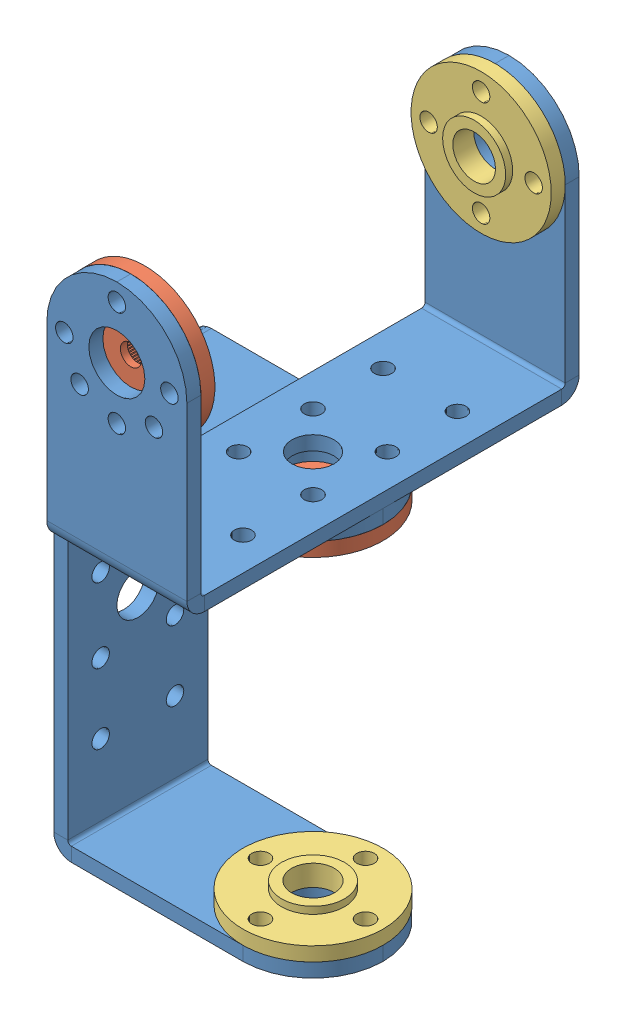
SolidWorks assembly Poignet.SLDASM, configuration Défaut (file format 11000). Lengths in mm.
Overall size (41.14 93 56).
6 component instances, 3 part files, 15 mates.
Components (placement in the parent):
- Chape-1: Chape.SLDPRT [Défaut] at origin size (20 37 56)
- PalierMotreur^AssemblageAccessoiresServo-1: PalierMotreur^AssemblageAccessoiresServo.sldprt [Défaut] at (10 25 25) size (20 20 4.8)
- PalierLibre-1: PalierLibre.SLDPRT [Défaut] at (0 25 -24) x (-1 0 0) z (0 0 -1) size (20 20 3)
- Chape-2: Chape.SLDPRT [Défaut] at (-25 -30 0) x (0 0 -1) z (0 -1 0) size (20 37 56)
- PalierMotreur^AssemblageAccessoiresServo-2: PalierMotreur^AssemblageAccessoiresServo.sldprt [Défaut] at (-7.0711 -5 7.0711) x (-0.707107 0 0.707107) z (0 1 0) size (20 20 4.8)
- PalierLibre-2: PalierLibre.SLDPRT [Défaut] at (0 -54 0) x (-1 0 0) z (0 -1 0) size (20 20 3)
Mates (geometry in assembly coordinates):
- Coïncidente1: coincident: plane of assembly; plane of assembly; plane of Chape-1 through (10 0 26) normal (0 0 -1); plane of PalierMotreur^AssemblageAccessoiresServo-1 through (0 25 26) normal (0 0 1)
- Coaxiale1: concentric: cylinder of assembly; cylinder of assembly; cylinder of Chape-1 through (0 25 -28) axis (0 0 1) radius 4; cylinder of PalierMotreur^AssemblageAccessoiresServo-1 through (0 25 21.2) axis (0 0 1) radius 4.5
- Coaxiale2: concentric: cylinder of assembly; cylinder of assembly; cylinder of Chape-1 through (7.5 25 -28) axis (0 0 1) radius 1.25; cylinder of PalierMotreur^AssemblageAccessoiresServo-1 through (7.5 25 19.7574) axis (0 0 1) radius 1.25
- Coïncidente2: coincident: plane of assembly; plane of assembly; plane of Chape-1 through (10 0 -26) normal (0 0 1); plane of PalierLibre-1 through (0 25 -26) normal (0 0 -1)
- Coaxiale3: concentric: cylinder of assembly; cylinder of assembly; cylinder of Chape-1 through (0 25 -28) axis (0 0 1) radius 4; cylinder of PalierLibre-1 through (0 25 -23) axis (0 0 -1) radius 3.05
- Coaxiale4: concentric: cylinder of assembly; cylinder of assembly; cylinder of Chape-1 through (0 17.5 -28) axis (0 0 1) radius 1.25; cylinder of PalierLibre-1 through (0 17.5 -26) axis (0 0 1) radius 1.25
- Coïncidente3: coincident: plane of assembly; plane of assembly; plane of Chape-1 through (10 -2 -26) normal (0 -1 0); plane of Chape-2 through (-25 -2 -10) normal (0 1 0)
- Coaxiale5: concentric: cylinder of assembly; cylinder of assembly; cylinder of Chape-1 through (0 -2 0) axis (0 1 0) radius 3; cylinder of Chape-2 through (0 -2 0) axis (0 -1 0) radius 4
- Perpendiculaire1: perpendicular: plane of assembly; plane of assembly; plane of Chape-1 through (-10 0.5 -28) normal (-1 0 0); plane of Chape-2 through (-24.5 -4.5 10) normal (0 0 1)
- Coaxiale6: concentric: cylinder of assembly; cylinder of assembly; cylinder of Chape-2 through (0 -2 0) axis (0 -1 0) radius 4; cylinder of PalierMotreur^AssemblageAccessoiresServo-2 through (0 -10.2426 0) axis (0 1 0) radius 1.5
- Coïncidente5: coincident: plane of assembly; plane of assembly; plane of Chape-2 through (-25 -4 -10) normal (0 -1 0); plane of PalierMotreur^AssemblageAccessoiresServo-2 through (0 -4 0) normal (0 1 0)
- Coaxiale7: concentric: cylinder of assembly; cylinder of assembly; cylinder of Chape-2 through (-5.3033 -2 -5.3033) axis (0 -1 0) radius 1.25; cylinder of PalierMotreur^AssemblageAccessoiresServo-2 through (-5.3033 -10.2426 -5.3033) axis (0 1 0) radius 1.25
- Coïncidente6: coincident: plane of assembly; plane of assembly; plane of Chape-2 through (-25 -56 -10) normal (0 1 0); plane of PalierLibre-2 through (0 -56 0) normal (0 -1 0)
- Coaxiale8: concentric: cylinder of assembly; cylinder of assembly; cylinder of Chape-2 through (0 -2 0) axis (0 -1 0) radius 4; cylinder of PalierLibre-2 through (0 -53 0) axis (0 -1 0) radius 3.05
- Coaxiale9: concentric: cylinder of assembly; cylinder of assembly; cylinder of Chape-2 through (0 -2 7.5) axis (0 -1 0) radius 1.25; cylinder of PalierLibre-2 through (0 -56 7.5) axis (0 1 0) radius 1.25
